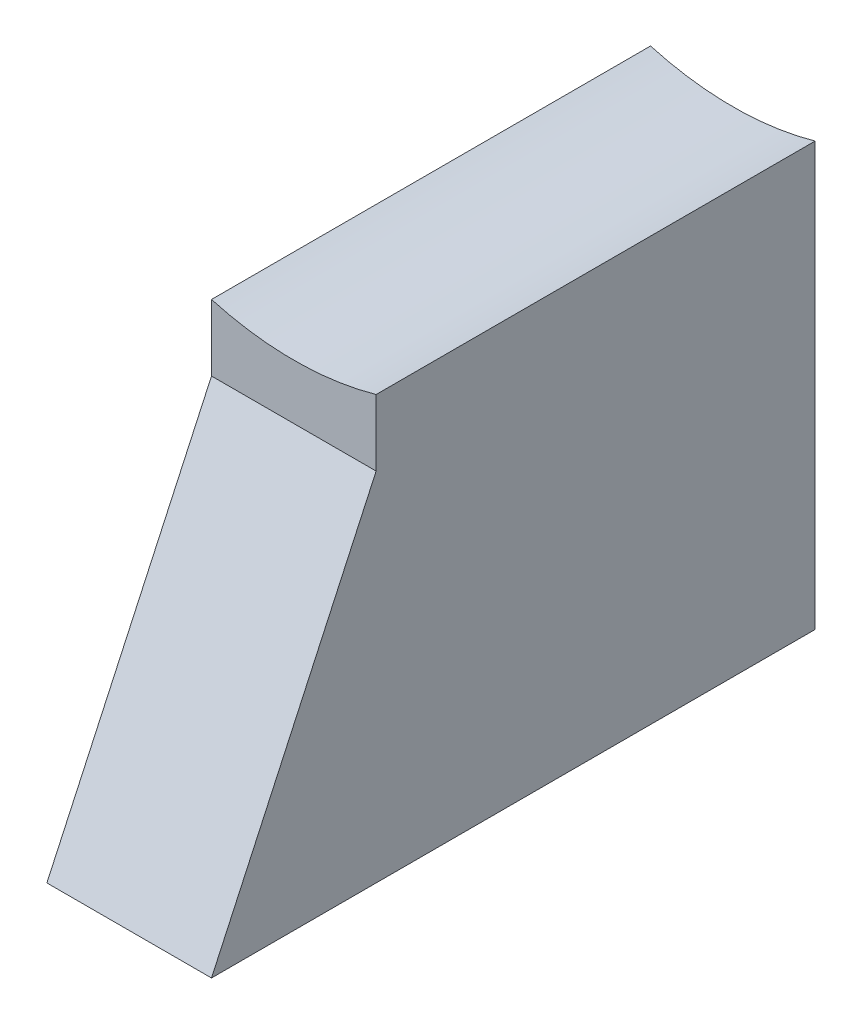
from build123d import *

# Parameters (mm, degrees)
SKETCH_1_R          = 3
EXTRUDE_1_DEPTH     = 6
SKETCH_2_W          = 32
SKETCH_2_H          = 2
CUT_EXTRUDE_1_DEPTH = 38.682887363
SKETCH_3_R          = 11
SKETCH_3_R_2        = 7
EXTRUDE_2_DEPTH     = 24
EXTRUDE_3_DEPTH     = 6
EXTRUDE_4_DEPTH     = 3
SKETCH_6_OUTSIDE_W  = 77.79
SKETCH_6_OUTSIDE_H  = 60.79
CUT_EXTRUDE_2_DEPTH = 28


with BuildPart() as part:
    # Sketch 1 → Extrude 1 (new body)
    with BuildSketch(Plane(origin=(0, 0, 0), x_dir=(1, 0, 0), z_dir=(0, 1, 0))):
        with BuildLine():
            Line((30, 0), (-30, 0))
            Line((-30, 0), (-30, -16))
            ThreePointArc((-30, -16), (-28.242640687, -20.242640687), (-24, -22))
            Line((-24, -22), (24, -22))
            ThreePointArc((24, -22), (28.242640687, -20.242640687), (30, -16))
            Line((30, -16), (30, 0))
        make_face()
        with Locations(Location((-24, -16, 0), (0, 0, 270))):
            Circle(SKETCH_1_R, mode=Mode.SUBTRACT)
        with Locations(Location((24, -16, 0), (0, 0, 90))):
            Circle(SKETCH_1_R, mode=Mode.SUBTRACT)
    extrude(amount=EXTRUDE_1_DEPTH)

    # Sketch 2 → Cut-Extrude 1 (cut, through all)
    with BuildSketch(Plane.XY.offset(22)):
        with Locations((0, 1)):
            Rectangle(SKETCH_2_W, SKETCH_2_H)
    extrude(amount=-CUT_EXTRUDE_1_DEPTH, mode=Mode.SUBTRACT)



with BuildPart() as body_2:
    # Sketch 3 → Extrude 2 (new body)
    with BuildSketch(Plane.XY.offset(-6)):
        with Locations((0, 32)):
            Circle(SKETCH_3_R)
        with Locations((0, 32)):
            Circle(SKETCH_3_R_2, mode=Mode.SUBTRACT)
    extrude(amount=EXTRUDE_2_DEPTH)


with BuildPart() as part_1:
    add(part.part)

    add(body_2.part)  # Extrude 3 merges body 2
    # Sketch 4 → Extrude 3 (add)
    with BuildSketch(Plane.XY):
        with BuildLine():
            Line((-10.355423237, 35.710149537), (-21, 6))
            Line((-21, 6), (21, 6))
            Line((21, 6), (10.355423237, 35.710149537))
            ThreePointArc((10.355423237, 35.710149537), (0, 21), (-10.355423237, 35.710149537))
        make_face()
    extrude(amount=EXTRUDE_3_DEPTH)

    # Sketch 5 → Extrude 4 (add, symmetric)
    with BuildSketch(Plane(origin=(0, 0, 0), x_dir=(0, 0, -1), z_dir=(1, 0, 0))):
        Polygon((-16, 22.836959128), (-6, 22.836959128), (-6, 6), (-22, 6), (-16, 19), align=None)
    extrude(amount=EXTRUDE_4_DEPTH, both=True)

    # Sketch 6 outside → Cut-Extrude 2 (cut, symmetric)
    with BuildSketch(Plane.XY):
        with Locations((0, 21.5)):
            Rectangle(SKETCH_6_OUTSIDE_W, SKETCH_6_OUTSIDE_H)
        with BuildLine():
            Line((-3, 21.416994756), (-3, 6))
            Line((-3, 6), (3, 6))
            Line((3, 6), (3, 21.416994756))
            ThreePointArc((3, 21.416994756), (0, 21), (-3, 21.416994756))
        make_face(mode=Mode.SUBTRACT)
    extrude(amount=CUT_EXTRUDE_2_DEPTH, both=True, mode=Mode.SUBTRACT)


solid = part_1.part
